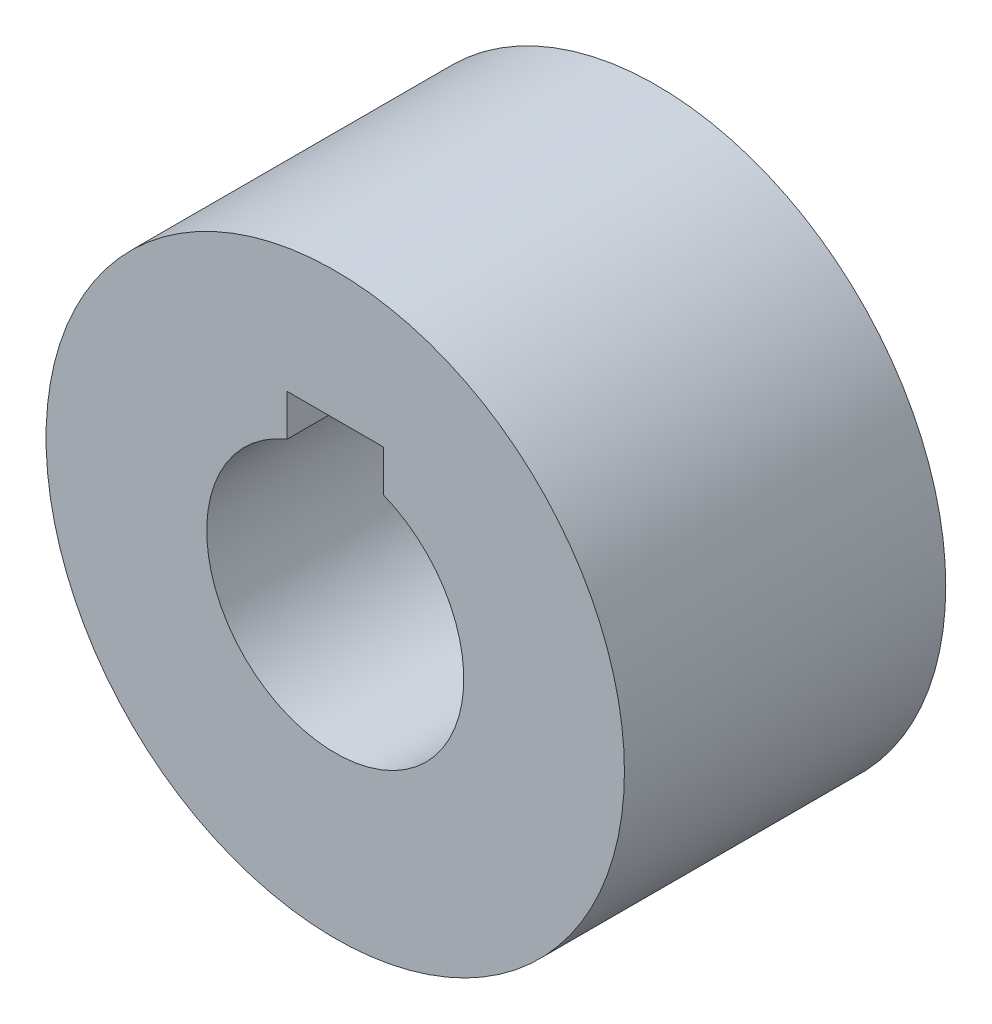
ISO-10303-21;
HEADER;
FILE_DESCRIPTION(('STEP AP214'),'2;1');
FILE_NAME('part.step','',(''),(''),'','','');
FILE_SCHEMA(('AUTOMOTIVE_DESIGN { 1 0 10303 214 1 1 1 1 }'));
ENDSEC;
DATA;
#1=APPLICATION_CONTEXT('core data for automotive mechanical design processes');
#2=APPLICATION_PROTOCOL_DEFINITION('international standard','automotive_design',2000,#1);
#3=PRODUCT_CONTEXT('',#1,'mechanical');
#4=PRODUCT('Part','Part','',(#3));
#5=PRODUCT_RELATED_PRODUCT_CATEGORY('part','',(#4));
#6=PRODUCT_DEFINITION_FORMATION('','',#4);
#7=PRODUCT_DEFINITION_CONTEXT('part definition',#1,'design');
#8=PRODUCT_DEFINITION('design','',#6,#7);
#9=PRODUCT_DEFINITION_SHAPE('','',#8);
#10=(LENGTH_UNIT() NAMED_UNIT(*) SI_UNIT(.MILLI.,.METRE.));
#11=(NAMED_UNIT(*) PLANE_ANGLE_UNIT() SI_UNIT($,.RADIAN.));
#12=(NAMED_UNIT(*) SI_UNIT($,.STERADIAN.) SOLID_ANGLE_UNIT());
#13=UNCERTAINTY_MEASURE_WITH_UNIT(LENGTH_MEASURE(1.E-05),#10,'distance_accuracy_value','');
#14=(GEOMETRIC_REPRESENTATION_CONTEXT(3) GLOBAL_UNCERTAINTY_ASSIGNED_CONTEXT((#13)) GLOBAL_UNIT_ASSIGNED_CONTEXT((#10,
#11,#12)) REPRESENTATION_CONTEXT('',''));
#15=CARTESIAN_POINT('',(0.,0.,0.));
#16=DIRECTION('',(0.,0.,1.));
#17=DIRECTION('',(1.,0.,0.));
#18=AXIS2_PLACEMENT_3D('',#15,#16,#17);
#19=CARTESIAN_POINT('',(0.,0.,20.));
#20=DIRECTION('',(0.,0.,1.));
#21=DIRECTION('',(1.,0.,0.));
#22=AXIS2_PLACEMENT_3D('',#19,#20,#21);
#23=PLANE('',#22);
#24=CARTESIAN_POINT('',(0.,0.,20.));
#25=DIRECTION('',(0.,0.,1.));
#26=DIRECTION('',(1.,0.,0.));
#27=AXIS2_PLACEMENT_3D('',#24,#25,#26);
#28=CIRCLE('',#27,18.);
#29=CARTESIAN_POINT('',(18.,0.,20.));
#30=VERTEX_POINT('',#29);
#31=EDGE_CURVE('E11',#30,#30,#28,.T.);
#32=ORIENTED_EDGE('',*,*,#31,.T.);
#33=EDGE_LOOP('',(#32));
#34=FACE_BOUND('',#33,.T.);
#35=DIRECTION('',(0.,1.,0.));
#36=VECTOR('',#35,1.);
#37=CARTESIAN_POINT('',(3.,7.41619848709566,20.));
#38=LINE('',#37,#36);
#39=CARTESIAN_POINT('',(3.,7.41619848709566,20.));
#40=VERTEX_POINT('',#39);
#41=CARTESIAN_POINT('',(3.,10.,20.));
#42=VERTEX_POINT('',#41);
#43=EDGE_CURVE('E79',#40,#42,#38,.T.);
#44=ORIENTED_EDGE('',*,*,#43,.F.);
#45=CARTESIAN_POINT('',(0.,0.,20.));
#46=DIRECTION('',(0.,0.,1.));
#47=DIRECTION('',(1.,0.,0.));
#48=AXIS2_PLACEMENT_3D('',#45,#46,#47);
#49=CIRCLE('',#48,8.);
#50=CARTESIAN_POINT('',(-3.,7.41619848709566,20.));
#51=VERTEX_POINT('',#50);
#52=EDGE_CURVE('E71',#51,#40,#49,.T.);
#53=ORIENTED_EDGE('',*,*,#52,.F.);
#54=DIRECTION('',(0.,-1.,0.));
#55=VECTOR('',#54,1.);
#56=CARTESIAN_POINT('',(-3.,7.41619848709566,20.));
#57=LINE('',#56,#55);
#58=CARTESIAN_POINT('',(-3.,10.,20.));
#59=VERTEX_POINT('',#58);
#60=EDGE_CURVE('E92',#59,#51,#57,.T.);
#61=ORIENTED_EDGE('',*,*,#60,.F.);
#62=DIRECTION('',(-1.,0.,0.));
#63=VECTOR('',#62,1.);
#64=CARTESIAN_POINT('',(-3.,10.,20.));
#65=LINE('',#64,#63);
#66=EDGE_CURVE('E90',#42,#59,#65,.T.);
#67=ORIENTED_EDGE('',*,*,#66,.F.);
#68=EDGE_LOOP('',(#44,#53,#61,#67));
#69=FACE_BOUND('',#68,.T.);
#70=ADVANCED_FACE('F30',(#34,#69),#23,.T.);
#71=CARTESIAN_POINT('',(0.,0.,0.));
#72=DIRECTION('',(0.,0.,1.));
#73=DIRECTION('',(1.,0.,0.));
#74=AXIS2_PLACEMENT_3D('',#71,#72,#73);
#75=PLANE('',#74);
#76=CARTESIAN_POINT('',(0.,0.,0.));
#77=DIRECTION('',(0.,0.,1.));
#78=DIRECTION('',(1.,0.,0.));
#79=AXIS2_PLACEMENT_3D('',#76,#77,#78);
#80=CIRCLE('',#79,18.);
#81=CARTESIAN_POINT('',(18.,0.,0.));
#82=VERTEX_POINT('',#81);
#83=EDGE_CURVE('E34',#82,#82,#80,.T.);
#84=ORIENTED_EDGE('',*,*,#83,.F.);
#85=EDGE_LOOP('',(#84));
#86=FACE_BOUND('',#85,.T.);
#87=CARTESIAN_POINT('',(0.,0.,0.));
#88=DIRECTION('',(0.,0.,1.));
#89=DIRECTION('',(1.,0.,0.));
#90=AXIS2_PLACEMENT_3D('',#87,#88,#89);
#91=CIRCLE('',#90,8.);
#92=CARTESIAN_POINT('',(-3.,7.41619848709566,0.));
#93=VERTEX_POINT('',#92);
#94=CARTESIAN_POINT('',(3.,7.41619848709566,0.));
#95=VERTEX_POINT('',#94);
#96=EDGE_CURVE('E53',#93,#95,#91,.T.);
#97=ORIENTED_EDGE('',*,*,#96,.T.);
#98=DIRECTION('',(0.,1.,0.));
#99=VECTOR('',#98,1.);
#100=CARTESIAN_POINT('',(3.,7.41619848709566,0.));
#101=LINE('',#100,#99);
#102=CARTESIAN_POINT('',(3.,10.,0.));
#103=VERTEX_POINT('',#102);
#104=EDGE_CURVE('E86',#95,#103,#101,.T.);
#105=ORIENTED_EDGE('',*,*,#104,.T.);
#106=DIRECTION('',(-1.,0.,0.));
#107=VECTOR('',#106,1.);
#108=CARTESIAN_POINT('',(-3.,10.,0.));
#109=LINE('',#108,#107);
#110=CARTESIAN_POINT('',(-3.,10.,0.));
#111=VERTEX_POINT('',#110);
#112=EDGE_CURVE('E98',#103,#111,#109,.T.);
#113=ORIENTED_EDGE('',*,*,#112,.T.);
#114=DIRECTION('',(0.,-1.,0.));
#115=VECTOR('',#114,1.);
#116=CARTESIAN_POINT('',(-3.,7.41619848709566,0.));
#117=LINE('',#116,#115);
#118=EDGE_CURVE('E80',#111,#93,#117,.T.);
#119=ORIENTED_EDGE('',*,*,#118,.T.);
#120=EDGE_LOOP('',(#97,#105,#113,#119));
#121=FACE_BOUND('',#120,.T.);
#122=ADVANCED_FACE('F109',(#86,#121),#75,.F.);
#123=CARTESIAN_POINT('',(0.,0.,20.));
#124=DIRECTION('',(0.,0.,-1.));
#125=DIRECTION('',(-1.,0.,0.));
#126=AXIS2_PLACEMENT_3D('',#123,#124,#125);
#127=CYLINDRICAL_SURFACE('',#126,18.);
#128=ORIENTED_EDGE('',*,*,#31,.F.);
#129=EDGE_LOOP('',(#128));
#130=FACE_BOUND('',#129,.T.);
#131=ORIENTED_EDGE('',*,*,#83,.T.);
#132=EDGE_LOOP('',(#131));
#133=FACE_BOUND('',#132,.T.);
#134=ADVANCED_FACE('F32',(#130,#133),#127,.T.);
#135=CARTESIAN_POINT('',(0.,0.,20.));
#136=DIRECTION('',(0.,0.,-1.));
#137=DIRECTION('',(-1.,0.,0.));
#138=AXIS2_PLACEMENT_3D('',#135,#136,#137);
#139=CYLINDRICAL_SURFACE('',#138,8.);
#140=ORIENTED_EDGE('',*,*,#96,.F.);
#141=DIRECTION('',(0.,0.,-1.));
#142=VECTOR('',#141,1.);
#143=CARTESIAN_POINT('',(-3.,7.41619848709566,20.));
#144=LINE('',#143,#142);
#145=EDGE_CURVE('E75',#51,#93,#144,.T.);
#146=ORIENTED_EDGE('',*,*,#145,.F.);
#147=ORIENTED_EDGE('',*,*,#52,.T.);
#148=DIRECTION('',(0.,0.,-1.));
#149=VECTOR('',#148,1.);
#150=CARTESIAN_POINT('',(3.,7.41619848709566,20.));
#151=LINE('',#150,#149);
#152=EDGE_CURVE('E74',#40,#95,#151,.T.);
#153=ORIENTED_EDGE('',*,*,#152,.T.);
#154=EDGE_LOOP('',(#140,#146,#147,#153));
#155=FACE_BOUND('',#154,.T.);
#156=ADVANCED_FACE('F73',(#155),#139,.F.);
#157=CARTESIAN_POINT('',(3.,7.41619848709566,20.));
#158=DIRECTION('',(-1.,0.,0.));
#159=DIRECTION('',(0.,0.,1.));
#160=AXIS2_PLACEMENT_3D('',#157,#158,#159);
#161=PLANE('',#160);
#162=ORIENTED_EDGE('',*,*,#104,.F.);
#163=ORIENTED_EDGE('',*,*,#152,.F.);
#164=ORIENTED_EDGE('',*,*,#43,.T.);
#165=DIRECTION('',(0.,0.,-1.));
#166=VECTOR('',#165,1.);
#167=CARTESIAN_POINT('',(3.,10.,20.));
#168=LINE('',#167,#166);
#169=EDGE_CURVE('E87',#42,#103,#168,.T.);
#170=ORIENTED_EDGE('',*,*,#169,.T.);
#171=EDGE_LOOP('',(#162,#163,#164,#170));
#172=FACE_BOUND('',#171,.T.);
#173=ADVANCED_FACE('F83',(#172),#161,.T.);
#174=CARTESIAN_POINT('',(-3.,10.,20.));
#175=DIRECTION('',(0.,-1.,0.));
#176=DIRECTION('',(0.,0.,-1.));
#177=AXIS2_PLACEMENT_3D('',#174,#175,#176);
#178=PLANE('',#177);
#179=ORIENTED_EDGE('',*,*,#112,.F.);
#180=ORIENTED_EDGE('',*,*,#169,.F.);
#181=ORIENTED_EDGE('',*,*,#66,.T.);
#182=DIRECTION('',(0.,0.,-1.));
#183=VECTOR('',#182,1.);
#184=CARTESIAN_POINT('',(-3.,10.,20.));
#185=LINE('',#184,#183);
#186=EDGE_CURVE('E45',#59,#111,#185,.T.);
#187=ORIENTED_EDGE('',*,*,#186,.T.);
#188=EDGE_LOOP('',(#179,#180,#181,#187));
#189=FACE_BOUND('',#188,.T.);
#190=ADVANCED_FACE('F107',(#189),#178,.T.);
#191=CARTESIAN_POINT('',(-3.,7.41619848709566,20.));
#192=DIRECTION('',(1.,0.,0.));
#193=DIRECTION('',(0.,1.,0.));
#194=AXIS2_PLACEMENT_3D('',#191,#192,#193);
#195=PLANE('',#194);
#196=ORIENTED_EDGE('',*,*,#118,.F.);
#197=ORIENTED_EDGE('',*,*,#186,.F.);
#198=ORIENTED_EDGE('',*,*,#60,.T.);
#199=ORIENTED_EDGE('',*,*,#145,.T.);
#200=EDGE_LOOP('',(#196,#197,#198,#199));
#201=FACE_BOUND('',#200,.T.);
#202=ADVANCED_FACE('F110',(#201),#195,.T.);
#203=CLOSED_SHELL('',(#70,#122,#134,#156,#173,#190,#202));
#204=MANIFOLD_SOLID_BREP('B2',#203);
#205=ADVANCED_BREP_SHAPE_REPRESENTATION('',(#18,#204),#14);
#206=SHAPE_DEFINITION_REPRESENTATION(#9,#205);
ENDSEC;
END-ISO-10303-21;
